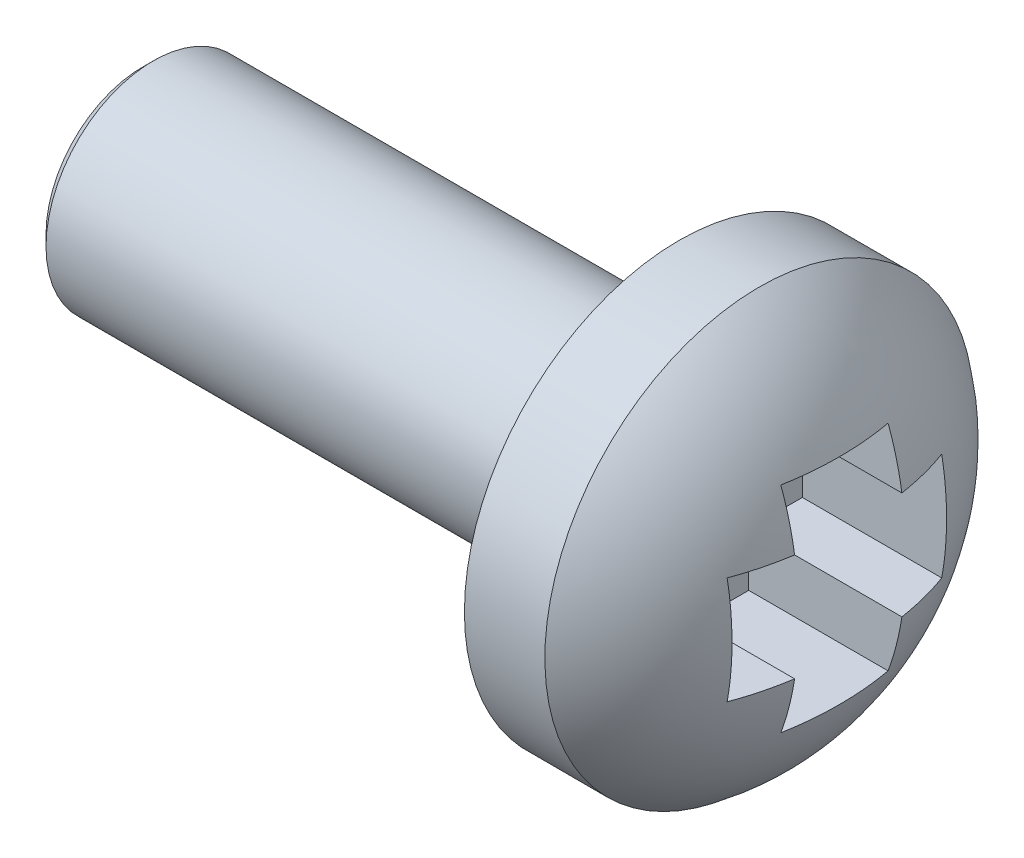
from build123d import *

# Parameters (mm, degrees)
CHANFREIN1_SIZE         = 0.2
ENL_V_START             = -3.5
ENL_V_MAT_EXTRU_1_DEPTH = 3.2


with BuildPart() as part:
    # Esquisse1 → R_volution1 (revolve)
    with BuildSketch(Plane.XY, mode=Mode.PRIVATE) as r_volution1_sk:
        with BuildLine():
            Line((-0.3, 2), (-0.3, 4))
            Line((-0.3, 4), (1.2, 4))
            add(Edge.make_bspline(
                [(1.2, 4), (3, 2.691799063), (3, 0)],
                knots=[0, 0, 0, 1, 1, 1], degree=2))
            Line((3, 0), (-10.3, 0))
            Line((-10.3, 0), (-10.3, 2))
            Line((-10.3, 2), (-0.3, 2))
        make_face()
    revolve(r_volution1_sk.sketch.rotate(Axis((11.061826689, 0, 0), (-1, 0, 0)), 90), axis=Axis((11.061826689, 0, 0), (-1, 0, 0)))

    # Chanfrein1
    chanfrein1_edges = [part.edges().sort_by_distance(p)[0] for p in [
        (-10.3, 0, 2),
    ]]
    chamfer(chanfrein1_edges, length=CHANFREIN1_SIZE)

    # Esquisse2 → Enl_v. mat.-Extru.1 (cut)
    with BuildSketch(Plane.ZY.offset(0.3).offset(ENL_V_START)):
        Polygon((-1, 1), (-2, 1), (-2, -1), (-1, -1), (-1, -2), (1, -2), (1, -1), (2, -1), (2, 1), (1, 1), (1, 2), (-1, 2), align=None)
    extrude(amount=ENL_V_MAT_EXTRU_1_DEPTH, mode=Mode.SUBTRACT)


solid = part.part
